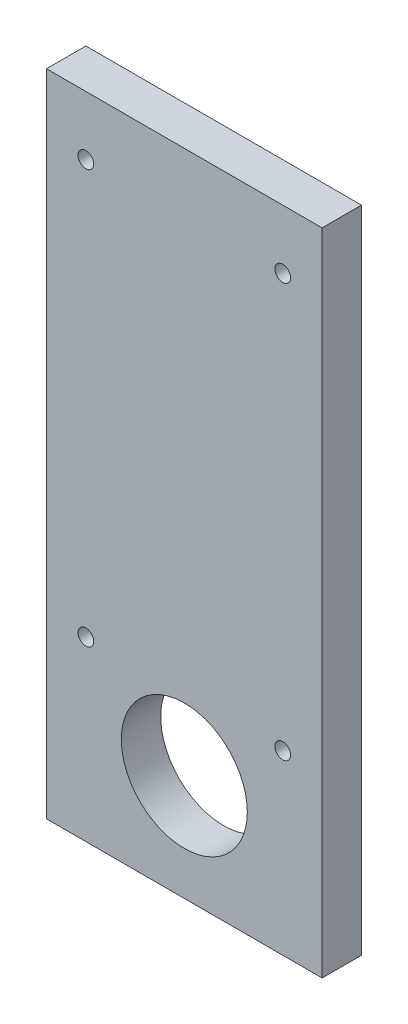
ISO-10303-21;
HEADER;
FILE_DESCRIPTION(('STEP AP214'),'2;1');
FILE_NAME('part.step','',(''),(''),'','','');
FILE_SCHEMA(('AUTOMOTIVE_DESIGN { 1 0 10303 214 1 1 1 1 }'));
ENDSEC;
DATA;
#1=APPLICATION_CONTEXT('core data for automotive mechanical design processes');
#2=APPLICATION_PROTOCOL_DEFINITION('international standard','automotive_design',2000,#1);
#3=PRODUCT_CONTEXT('',#1,'mechanical');
#4=PRODUCT('Part','Part','',(#3));
#5=PRODUCT_RELATED_PRODUCT_CATEGORY('part','',(#4));
#6=PRODUCT_DEFINITION_FORMATION('','',#4);
#7=PRODUCT_DEFINITION_CONTEXT('part definition',#1,'design');
#8=PRODUCT_DEFINITION('design','',#6,#7);
#9=PRODUCT_DEFINITION_SHAPE('','',#8);
#10=(LENGTH_UNIT() NAMED_UNIT(*) SI_UNIT(.MILLI.,.METRE.));
#11=(NAMED_UNIT(*) PLANE_ANGLE_UNIT() SI_UNIT($,.RADIAN.));
#12=(NAMED_UNIT(*) SI_UNIT($,.STERADIAN.) SOLID_ANGLE_UNIT());
#13=UNCERTAINTY_MEASURE_WITH_UNIT(LENGTH_MEASURE(1.E-05),#10,'distance_accuracy_value','');
#14=(GEOMETRIC_REPRESENTATION_CONTEXT(3) GLOBAL_UNCERTAINTY_ASSIGNED_CONTEXT((#13)) GLOBAL_UNIT_ASSIGNED_CONTEXT((#10,
#11,#12)) REPRESENTATION_CONTEXT('',''));
#15=CARTESIAN_POINT('',(0.,0.,0.));
#16=DIRECTION('',(0.,0.,1.));
#17=DIRECTION('',(1.,0.,0.));
#18=AXIS2_PLACEMENT_3D('',#15,#16,#17);
#19=CARTESIAN_POINT('',(35.,138.,10.));
#20=DIRECTION('',(0.,0.,1.));
#21=DIRECTION('',(1.,0.,0.));
#22=AXIS2_PLACEMENT_3D('',#19,#20,#21);
#23=PLANE('',#22);
#24=CARTESIAN_POINT('',(25.,18.,10.));
#25=DIRECTION('',(0.,0.,1.));
#26=DIRECTION('',(1.,0.,0.));
#27=AXIS2_PLACEMENT_3D('',#24,#25,#26);
#28=CIRCLE('',#27,2.);
#29=CARTESIAN_POINT('',(27.,18.,10.));
#30=VERTEX_POINT('',#29);
#31=EDGE_CURVE('E112',#30,#30,#28,.T.);
#32=ORIENTED_EDGE('',*,*,#31,.F.);
#33=EDGE_LOOP('',(#32));
#34=FACE_BOUND('',#33,.T.);
#35=CARTESIAN_POINT('',(-25.,123.,10.));
#36=DIRECTION('',(0.,0.,1.));
#37=DIRECTION('',(1.,0.,0.));
#38=AXIS2_PLACEMENT_3D('',#35,#36,#37);
#39=CIRCLE('',#38,2.00000000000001);
#40=CARTESIAN_POINT('',(-23.,123.,10.));
#41=VERTEX_POINT('',#40);
#42=EDGE_CURVE('E124',#41,#41,#39,.T.);
#43=ORIENTED_EDGE('',*,*,#42,.F.);
#44=EDGE_LOOP('',(#43));
#45=FACE_BOUND('',#44,.T.);
#46=DIRECTION('',(0.,1.,0.));
#47=VECTOR('',#46,1.);
#48=CARTESIAN_POINT('',(35.,-27.,10.));
#49=LINE('',#48,#47);
#50=CARTESIAN_POINT('',(35.,-27.,10.));
#51=VERTEX_POINT('',#50);
#52=CARTESIAN_POINT('',(35.,138.,10.));
#53=VERTEX_POINT('',#52);
#54=EDGE_CURVE('E136',#51,#53,#49,.T.);
#55=ORIENTED_EDGE('',*,*,#54,.T.);
#56=DIRECTION('',(-1.,0.,0.));
#57=VECTOR('',#56,1.);
#58=CARTESIAN_POINT('',(35.,138.,10.));
#59=LINE('',#58,#57);
#60=CARTESIAN_POINT('',(-35.,138.,10.));
#61=VERTEX_POINT('',#60);
#62=EDGE_CURVE('E78',#53,#61,#59,.T.);
#63=ORIENTED_EDGE('',*,*,#62,.T.);
#64=DIRECTION('',(0.,-1.,0.));
#65=VECTOR('',#64,1.);
#66=CARTESIAN_POINT('',(-35.,138.,10.));
#67=LINE('',#66,#65);
#68=CARTESIAN_POINT('',(-35.,-27.,10.));
#69=VERTEX_POINT('',#68);
#70=EDGE_CURVE('E139',#61,#69,#67,.T.);
#71=ORIENTED_EDGE('',*,*,#70,.T.);
#72=DIRECTION('',(1.,0.,0.));
#73=VECTOR('',#72,1.);
#74=CARTESIAN_POINT('',(-35.,-27.,10.));
#75=LINE('',#74,#73);
#76=EDGE_CURVE('E47',#69,#51,#75,.T.);
#77=ORIENTED_EDGE('',*,*,#76,.T.);
#78=EDGE_LOOP('',(#55,#63,#71,#77));
#79=FACE_BOUND('',#78,.T.);
#80=CARTESIAN_POINT('',(0.,0.,10.));
#81=DIRECTION('',(0.,0.,1.));
#82=DIRECTION('',(1.,0.,0.));
#83=AXIS2_PLACEMENT_3D('',#80,#81,#82);
#84=CIRCLE('',#83,16.);
#85=CARTESIAN_POINT('',(16.,0.,10.));
#86=VERTEX_POINT('',#85);
#87=EDGE_CURVE('E130',#86,#86,#84,.T.);
#88=ORIENTED_EDGE('',*,*,#87,.F.);
#89=EDGE_LOOP('',(#88));
#90=FACE_BOUND('',#89,.T.);
#91=CARTESIAN_POINT('',(25.,123.,10.));
#92=DIRECTION('',(0.,0.,1.));
#93=DIRECTION('',(1.,0.,0.));
#94=AXIS2_PLACEMENT_3D('',#91,#92,#93);
#95=CIRCLE('',#94,2.);
#96=CARTESIAN_POINT('',(27.,123.,10.));
#97=VERTEX_POINT('',#96);
#98=EDGE_CURVE('E118',#97,#97,#95,.T.);
#99=ORIENTED_EDGE('',*,*,#98,.F.);
#100=EDGE_LOOP('',(#99));
#101=FACE_BOUND('',#100,.T.);
#102=CARTESIAN_POINT('',(-25.,18.,10.));
#103=DIRECTION('',(0.,0.,1.));
#104=DIRECTION('',(1.,0.,0.));
#105=AXIS2_PLACEMENT_3D('',#102,#103,#104);
#106=CIRCLE('',#105,2.);
#107=CARTESIAN_POINT('',(-23.,18.,10.));
#108=VERTEX_POINT('',#107);
#109=EDGE_CURVE('E106',#108,#108,#106,.T.);
#110=ORIENTED_EDGE('',*,*,#109,.F.);
#111=EDGE_LOOP('',(#110));
#112=FACE_BOUND('',#111,.T.);
#113=ADVANCED_FACE('F30',(#34,#45,#79,#90,#101,#112),#23,.T.);
#114=CARTESIAN_POINT('',(35.,138.,0.));
#115=DIRECTION('',(0.,0.,1.));
#116=DIRECTION('',(1.,0.,0.));
#117=AXIS2_PLACEMENT_3D('',#114,#115,#116);
#118=PLANE('',#117);
#119=CARTESIAN_POINT('',(25.,18.,0.));
#120=DIRECTION('',(0.,0.,1.));
#121=DIRECTION('',(1.,0.,0.));
#122=AXIS2_PLACEMENT_3D('',#119,#120,#121);
#123=CIRCLE('',#122,2.);
#124=CARTESIAN_POINT('',(27.,18.,0.));
#125=VERTEX_POINT('',#124);
#126=EDGE_CURVE('E109',#125,#125,#123,.T.);
#127=ORIENTED_EDGE('',*,*,#126,.T.);
#128=EDGE_LOOP('',(#127));
#129=FACE_BOUND('',#128,.T.);
#130=CARTESIAN_POINT('',(-25.,123.,0.));
#131=DIRECTION('',(0.,0.,1.));
#132=DIRECTION('',(1.,0.,0.));
#133=AXIS2_PLACEMENT_3D('',#130,#131,#132);
#134=CIRCLE('',#133,2.00000000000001);
#135=CARTESIAN_POINT('',(-23.,123.,0.));
#136=VERTEX_POINT('',#135);
#137=EDGE_CURVE('E121',#136,#136,#134,.T.);
#138=ORIENTED_EDGE('',*,*,#137,.T.);
#139=EDGE_LOOP('',(#138));
#140=FACE_BOUND('',#139,.T.);
#141=DIRECTION('',(0.,1.,0.));
#142=VECTOR('',#141,1.);
#143=CARTESIAN_POINT('',(35.,-27.,0.));
#144=LINE('',#143,#142);
#145=CARTESIAN_POINT('',(35.,-27.,0.));
#146=VERTEX_POINT('',#145);
#147=CARTESIAN_POINT('',(35.,138.,0.));
#148=VERTEX_POINT('',#147);
#149=EDGE_CURVE('E133',#146,#148,#144,.T.);
#150=ORIENTED_EDGE('',*,*,#149,.F.);
#151=DIRECTION('',(1.,0.,0.));
#152=VECTOR('',#151,1.);
#153=CARTESIAN_POINT('',(-35.,-27.,0.));
#154=LINE('',#153,#152);
#155=CARTESIAN_POINT('',(-35.,-27.,0.));
#156=VERTEX_POINT('',#155);
#157=EDGE_CURVE('E71',#156,#146,#154,.T.);
#158=ORIENTED_EDGE('',*,*,#157,.F.);
#159=DIRECTION('',(0.,-1.,0.));
#160=VECTOR('',#159,1.);
#161=CARTESIAN_POINT('',(-35.,138.,0.));
#162=LINE('',#161,#160);
#163=CARTESIAN_POINT('',(-35.,138.,0.));
#164=VERTEX_POINT('',#163);
#165=EDGE_CURVE('E65',#164,#156,#162,.T.);
#166=ORIENTED_EDGE('',*,*,#165,.F.);
#167=DIRECTION('',(-1.,0.,0.));
#168=VECTOR('',#167,1.);
#169=CARTESIAN_POINT('',(35.,138.,0.));
#170=LINE('',#169,#168);
#171=EDGE_CURVE('E145',#148,#164,#170,.T.);
#172=ORIENTED_EDGE('',*,*,#171,.F.);
#173=EDGE_LOOP('',(#150,#158,#166,#172));
#174=FACE_BOUND('',#173,.T.);
#175=CARTESIAN_POINT('',(0.,0.,0.));
#176=DIRECTION('',(0.,0.,1.));
#177=DIRECTION('',(1.,0.,0.));
#178=AXIS2_PLACEMENT_3D('',#175,#176,#177);
#179=CIRCLE('',#178,16.);
#180=CARTESIAN_POINT('',(16.,0.,0.));
#181=VERTEX_POINT('',#180);
#182=EDGE_CURVE('E127',#181,#181,#179,.T.);
#183=ORIENTED_EDGE('',*,*,#182,.T.);
#184=EDGE_LOOP('',(#183));
#185=FACE_BOUND('',#184,.T.);
#186=CARTESIAN_POINT('',(25.,123.,0.));
#187=DIRECTION('',(0.,0.,1.));
#188=DIRECTION('',(1.,0.,0.));
#189=AXIS2_PLACEMENT_3D('',#186,#187,#188);
#190=CIRCLE('',#189,2.);
#191=CARTESIAN_POINT('',(27.,123.,0.));
#192=VERTEX_POINT('',#191);
#193=EDGE_CURVE('E115',#192,#192,#190,.T.);
#194=ORIENTED_EDGE('',*,*,#193,.T.);
#195=EDGE_LOOP('',(#194));
#196=FACE_BOUND('',#195,.T.);
#197=CARTESIAN_POINT('',(-25.,18.,0.));
#198=DIRECTION('',(0.,0.,1.));
#199=DIRECTION('',(1.,0.,0.));
#200=AXIS2_PLACEMENT_3D('',#197,#198,#199);
#201=CIRCLE('',#200,2.);
#202=CARTESIAN_POINT('',(-23.,18.,0.));
#203=VERTEX_POINT('',#202);
#204=EDGE_CURVE('E105',#203,#203,#201,.T.);
#205=ORIENTED_EDGE('',*,*,#204,.T.);
#206=EDGE_LOOP('',(#205));
#207=FACE_BOUND('',#206,.T.);
#208=ADVANCED_FACE('F155',(#129,#140,#174,#185,#196,#207),#118,.F.);
#209=CARTESIAN_POINT('',(35.,-27.,10.));
#210=DIRECTION('',(-1.,0.,0.));
#211=DIRECTION('',(0.,0.,1.));
#212=AXIS2_PLACEMENT_3D('',#209,#210,#211);
#213=PLANE('',#212);
#214=ORIENTED_EDGE('',*,*,#149,.T.);
#215=DIRECTION('',(0.,0.,-1.));
#216=VECTOR('',#215,1.);
#217=CARTESIAN_POINT('',(35.,138.,10.));
#218=LINE('',#217,#216);
#219=EDGE_CURVE('E11',#53,#148,#218,.T.);
#220=ORIENTED_EDGE('',*,*,#219,.F.);
#221=ORIENTED_EDGE('',*,*,#54,.F.);
#222=DIRECTION('',(0.,0.,-1.));
#223=VECTOR('',#222,1.);
#224=CARTESIAN_POINT('',(35.,-27.,10.));
#225=LINE('',#224,#223);
#226=EDGE_CURVE('E142',#51,#146,#225,.T.);
#227=ORIENTED_EDGE('',*,*,#226,.T.);
#228=EDGE_LOOP('',(#214,#220,#221,#227));
#229=FACE_BOUND('',#228,.T.);
#230=ADVANCED_FACE('F32',(#229),#213,.F.);
#231=CARTESIAN_POINT('',(35.,138.,10.));
#232=DIRECTION('',(0.,-1.,0.));
#233=DIRECTION('',(0.,0.,-1.));
#234=AXIS2_PLACEMENT_3D('',#231,#232,#233);
#235=PLANE('',#234);
#236=ORIENTED_EDGE('',*,*,#171,.T.);
#237=DIRECTION('',(0.,0.,-1.));
#238=VECTOR('',#237,1.);
#239=CARTESIAN_POINT('',(-35.,138.,10.));
#240=LINE('',#239,#238);
#241=EDGE_CURVE('E39',#61,#164,#240,.T.);
#242=ORIENTED_EDGE('',*,*,#241,.F.);
#243=ORIENTED_EDGE('',*,*,#62,.F.);
#244=ORIENTED_EDGE('',*,*,#219,.T.);
#245=EDGE_LOOP('',(#236,#242,#243,#244));
#246=FACE_BOUND('',#245,.T.);
#247=ADVANCED_FACE('F172',(#246),#235,.F.);
#248=CARTESIAN_POINT('',(-35.,138.,10.));
#249=DIRECTION('',(1.,0.,0.));
#250=DIRECTION('',(0.,1.,0.));
#251=AXIS2_PLACEMENT_3D('',#248,#249,#250);
#252=PLANE('',#251);
#253=ORIENTED_EDGE('',*,*,#165,.T.);
#254=DIRECTION('',(0.,0.,-1.));
#255=VECTOR('',#254,1.);
#256=CARTESIAN_POINT('',(-35.,-27.,10.));
#257=LINE('',#256,#255);
#258=EDGE_CURVE('E150',#69,#156,#257,.T.);
#259=ORIENTED_EDGE('',*,*,#258,.F.);
#260=ORIENTED_EDGE('',*,*,#70,.F.);
#261=ORIENTED_EDGE('',*,*,#241,.T.);
#262=EDGE_LOOP('',(#253,#259,#260,#261));
#263=FACE_BOUND('',#262,.T.);
#264=ADVANCED_FACE('F152',(#263),#252,.F.);
#265=CARTESIAN_POINT('',(-35.,-27.,10.));
#266=DIRECTION('',(0.,1.,0.));
#267=DIRECTION('',(0.,0.,1.));
#268=AXIS2_PLACEMENT_3D('',#265,#266,#267);
#269=PLANE('',#268);
#270=CARTESIAN_POINT('',(-25.,-27.,5.));
#271=DIRECTION('',(0.,-1.,0.));
#272=DIRECTION('',(0.,0.,-1.));
#273=AXIS2_PLACEMENT_3D('',#270,#271,#272);
#274=CIRCLE('',#273,1.65);
#275=CARTESIAN_POINT('',(-25.,-27.,3.35));
#276=VERTEX_POINT('',#275);
#277=EDGE_CURVE('E94',#276,#276,#274,.T.);
#278=ORIENTED_EDGE('',*,*,#277,.F.);
#279=EDGE_LOOP('',(#278));
#280=FACE_BOUND('',#279,.T.);
#281=CARTESIAN_POINT('',(25.,-27.,5.));
#282=DIRECTION('',(0.,-1.,0.));
#283=DIRECTION('',(0.,0.,-1.));
#284=AXIS2_PLACEMENT_3D('',#281,#282,#283);
#285=CIRCLE('',#284,1.65);
#286=CARTESIAN_POINT('',(25.,-27.,3.35));
#287=VERTEX_POINT('',#286);
#288=EDGE_CURVE('E102',#287,#287,#285,.T.);
#289=ORIENTED_EDGE('',*,*,#288,.F.);
#290=EDGE_LOOP('',(#289));
#291=FACE_BOUND('',#290,.T.);
#292=ORIENTED_EDGE('',*,*,#157,.T.);
#293=ORIENTED_EDGE('',*,*,#226,.F.);
#294=ORIENTED_EDGE('',*,*,#76,.F.);
#295=ORIENTED_EDGE('',*,*,#258,.T.);
#296=EDGE_LOOP('',(#292,#293,#294,#295));
#297=FACE_BOUND('',#296,.T.);
#298=ADVANCED_FACE('F160',(#280,#291,#297),#269,.F.);
#299=CARTESIAN_POINT('',(0.,0.,10.));
#300=DIRECTION('',(0.,0.,-1.));
#301=DIRECTION('',(-1.,0.,0.));
#302=AXIS2_PLACEMENT_3D('',#299,#300,#301);
#303=CYLINDRICAL_SURFACE('',#302,16.);
#304=ORIENTED_EDGE('',*,*,#87,.T.);
#305=EDGE_LOOP('',(#304));
#306=FACE_BOUND('',#305,.T.);
#307=ORIENTED_EDGE('',*,*,#182,.F.);
#308=EDGE_LOOP('',(#307));
#309=FACE_BOUND('',#308,.T.);
#310=ADVANCED_FACE('F162',(#306,#309),#303,.F.);
#311=CARTESIAN_POINT('',(-25.,123.,10.));
#312=DIRECTION('',(0.,0.,-1.));
#313=DIRECTION('',(-1.,0.,0.));
#314=AXIS2_PLACEMENT_3D('',#311,#312,#313);
#315=CYLINDRICAL_SURFACE('',#314,2.00000000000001);
#316=ORIENTED_EDGE('',*,*,#42,.T.);
#317=EDGE_LOOP('',(#316));
#318=FACE_BOUND('',#317,.T.);
#319=ORIENTED_EDGE('',*,*,#137,.F.);
#320=EDGE_LOOP('',(#319));
#321=FACE_BOUND('',#320,.T.);
#322=ADVANCED_FACE('F169',(#318,#321),#315,.F.);
#323=CARTESIAN_POINT('',(25.,123.,10.));
#324=DIRECTION('',(0.,0.,-1.));
#325=DIRECTION('',(-1.,0.,0.));
#326=AXIS2_PLACEMENT_3D('',#323,#324,#325);
#327=CYLINDRICAL_SURFACE('',#326,2.);
#328=ORIENTED_EDGE('',*,*,#98,.T.);
#329=EDGE_LOOP('',(#328));
#330=FACE_BOUND('',#329,.T.);
#331=ORIENTED_EDGE('',*,*,#193,.F.);
#332=EDGE_LOOP('',(#331));
#333=FACE_BOUND('',#332,.T.);
#334=ADVANCED_FACE('F189',(#330,#333),#327,.F.);
#335=CARTESIAN_POINT('',(25.,18.,10.));
#336=DIRECTION('',(0.,0.,-1.));
#337=DIRECTION('',(-1.,0.,0.));
#338=AXIS2_PLACEMENT_3D('',#335,#336,#337);
#339=CYLINDRICAL_SURFACE('',#338,2.);
#340=ORIENTED_EDGE('',*,*,#31,.T.);
#341=EDGE_LOOP('',(#340));
#342=FACE_BOUND('',#341,.T.);
#343=ORIENTED_EDGE('',*,*,#126,.F.);
#344=EDGE_LOOP('',(#343));
#345=FACE_BOUND('',#344,.T.);
#346=ADVANCED_FACE('F193',(#342,#345),#339,.F.);
#347=CARTESIAN_POINT('',(-25.,18.,10.));
#348=DIRECTION('',(0.,0.,-1.));
#349=DIRECTION('',(-1.,0.,0.));
#350=AXIS2_PLACEMENT_3D('',#347,#348,#349);
#351=CYLINDRICAL_SURFACE('',#350,2.);
#352=ORIENTED_EDGE('',*,*,#109,.T.);
#353=EDGE_LOOP('',(#352));
#354=FACE_BOUND('',#353,.T.);
#355=ORIENTED_EDGE('',*,*,#204,.F.);
#356=EDGE_LOOP('',(#355));
#357=FACE_BOUND('',#356,.T.);
#358=ADVANCED_FACE('F197',(#354,#357),#351,.F.);
#359=CARTESIAN_POINT('',(25.,-27.,5.));
#360=DIRECTION('',(0.,-1.,0.));
#361=DIRECTION('',(0.,0.,-1.));
#362=AXIS2_PLACEMENT_3D('',#359,#360,#361);
#363=CYLINDRICAL_SURFACE('',#362,1.65);
#364=CARTESIAN_POINT('',(25.,-12.,5.));
#365=DIRECTION('',(0.,-1.,0.));
#366=DIRECTION('',(0.,0.,-1.));
#367=AXIS2_PLACEMENT_3D('',#364,#365,#366);
#368=CIRCLE('',#367,1.65);
#369=CARTESIAN_POINT('',(25.,-12.,3.35));
#370=VERTEX_POINT('',#369);
#371=EDGE_CURVE('E97',#370,#370,#368,.T.);
#372=ORIENTED_EDGE('',*,*,#371,.F.);
#373=EDGE_LOOP('',(#372));
#374=FACE_BOUND('',#373,.T.);
#375=ORIENTED_EDGE('',*,*,#288,.T.);
#376=EDGE_LOOP('',(#375));
#377=FACE_BOUND('',#376,.T.);
#378=ADVANCED_FACE('F201',(#374,#377),#363,.F.);
#379=CARTESIAN_POINT('',(25.,-12.,5.));
#380=DIRECTION('',(0.,-1.,0.));
#381=DIRECTION('',(0.,0.,-1.));
#382=AXIS2_PLACEMENT_3D('',#379,#380,#381);
#383=CONICAL_SURFACE('',#382,1.65,1.02974425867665);
#384=CARTESIAN_POINT('',(25.,-11.0085799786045,5.));
#385=VERTEX_POINT('',#384);
#386=VERTEX_LOOP('',#385);
#387=FACE_BOUND('',#386,.T.);
#388=ORIENTED_EDGE('',*,*,#371,.T.);
#389=EDGE_LOOP('',(#388));
#390=FACE_BOUND('',#389,.T.);
#391=ADVANCED_FACE('F205',(#387,#390),#383,.F.);
#392=CARTESIAN_POINT('',(-25.,-27.,5.));
#393=DIRECTION('',(0.,-1.,0.));
#394=DIRECTION('',(0.,0.,-1.));
#395=AXIS2_PLACEMENT_3D('',#392,#393,#394);
#396=CYLINDRICAL_SURFACE('',#395,1.65);
#397=CARTESIAN_POINT('',(-25.,-12.,5.));
#398=DIRECTION('',(0.,-1.,0.));
#399=DIRECTION('',(0.,0.,-1.));
#400=AXIS2_PLACEMENT_3D('',#397,#398,#399);
#401=CIRCLE('',#400,1.65);
#402=CARTESIAN_POINT('',(-25.,-12.,3.35));
#403=VERTEX_POINT('',#402);
#404=EDGE_CURVE('E92',#403,#403,#401,.T.);
#405=ORIENTED_EDGE('',*,*,#404,.F.);
#406=EDGE_LOOP('',(#405));
#407=FACE_BOUND('',#406,.T.);
#408=ORIENTED_EDGE('',*,*,#277,.T.);
#409=EDGE_LOOP('',(#408));
#410=FACE_BOUND('',#409,.T.);
#411=ADVANCED_FACE('F88',(#407,#410),#396,.F.);
#412=CARTESIAN_POINT('',(-25.,-12.,5.));
#413=DIRECTION('',(0.,-1.,0.));
#414=DIRECTION('',(0.,0.,-1.));
#415=AXIS2_PLACEMENT_3D('',#412,#413,#414);
#416=CONICAL_SURFACE('',#415,1.65,1.02974425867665);
#417=CARTESIAN_POINT('',(-25.,-11.0085799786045,5.));
#418=VERTEX_POINT('',#417);
#419=VERTEX_LOOP('',#418);
#420=FACE_BOUND('',#419,.T.);
#421=ORIENTED_EDGE('',*,*,#404,.T.);
#422=EDGE_LOOP('',(#421));
#423=FACE_BOUND('',#422,.T.);
#424=ADVANCED_FACE('F85',(#420,#423),#416,.F.);
#425=CLOSED_SHELL('',(#113,#208,#230,#247,#264,#298,#310,#322,#334,#346,#358,#378,#391,#411,#424));
#426=MANIFOLD_SOLID_BREP('B2',#425);
#427=ADVANCED_BREP_SHAPE_REPRESENTATION('',(#18,#426),#14);
#428=SHAPE_DEFINITION_REPRESENTATION(#9,#427);
ENDSEC;
END-ISO-10303-21;
